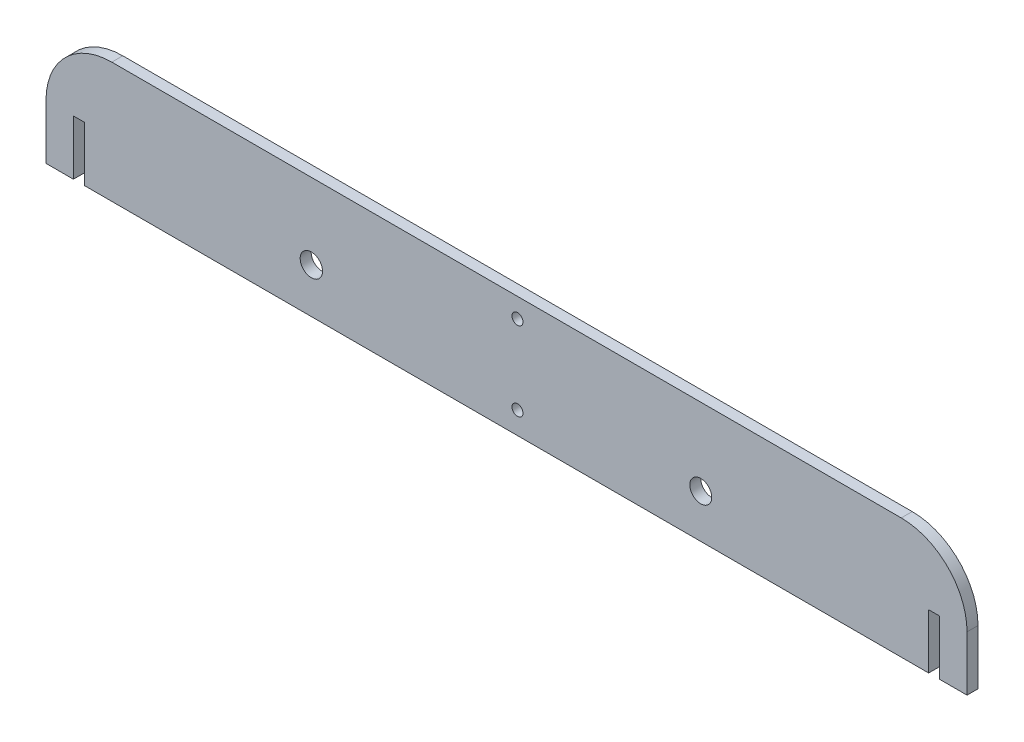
from build123d import *

# Parameters (mm, degrees)
SALIENTE_EXTRUIR1_DEPTH = 2.5
CROQUIS2_R              = 5.093311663
CROQUIS2_R_2            = 5
CROQUIS2_R_3            = 2.5
CROQUIS2_R_4            = 2.505628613
CROQUIS2_W              = 5
CROQUIS2_H              = 25
CORTAR_EXTRUIR1_DEPTH   = 218.140507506


with BuildPart() as part:
    # Croquis1 → Saliente-Extruir1 (new, symmetric)
    with BuildSketch(Plane.XY):
        with BuildLine():
            Line((210, 0), (-210, 0))
            Line((-210, 0), (-210, 25))
            ThreePointArc((-210, 25), (-201.213203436, 46.213203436), (-180, 55))
            Line((-180, 55), (180, 55))
            ThreePointArc((180, 55), (201.213203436, 46.213203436), (210, 25))
            Line((210, 25), (210, 0))
        make_face()
    extrude(amount=SALIENTE_EXTRUIR1_DEPTH, both=True)

    # Croquis2 → Cortar-Extruir1 (cut, through all)
    with BuildSketch(Plane.XY.offset(2.5)):
        with Locations((-89, 20.441338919)):
            Circle(CROQUIS2_R)
        with Locations((88.580212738, 19.863618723)):
            Circle(CROQUIS2_R_2)
        with Locations((5, 10.1)):
            Circle(CROQUIS2_R_3)
        with Locations((5, 46.094371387)):
            Circle(CROQUIS2_R_4)
        with Locations((195, 12.5)):
            Rectangle(CROQUIS2_W, CROQUIS2_H)
        with Locations((-195, 12.5)):
            Rectangle(CROQUIS2_W, CROQUIS2_H)
    extrude(amount=-CORTAR_EXTRUIR1_DEPTH, mode=Mode.SUBTRACT)


solid = part.part
